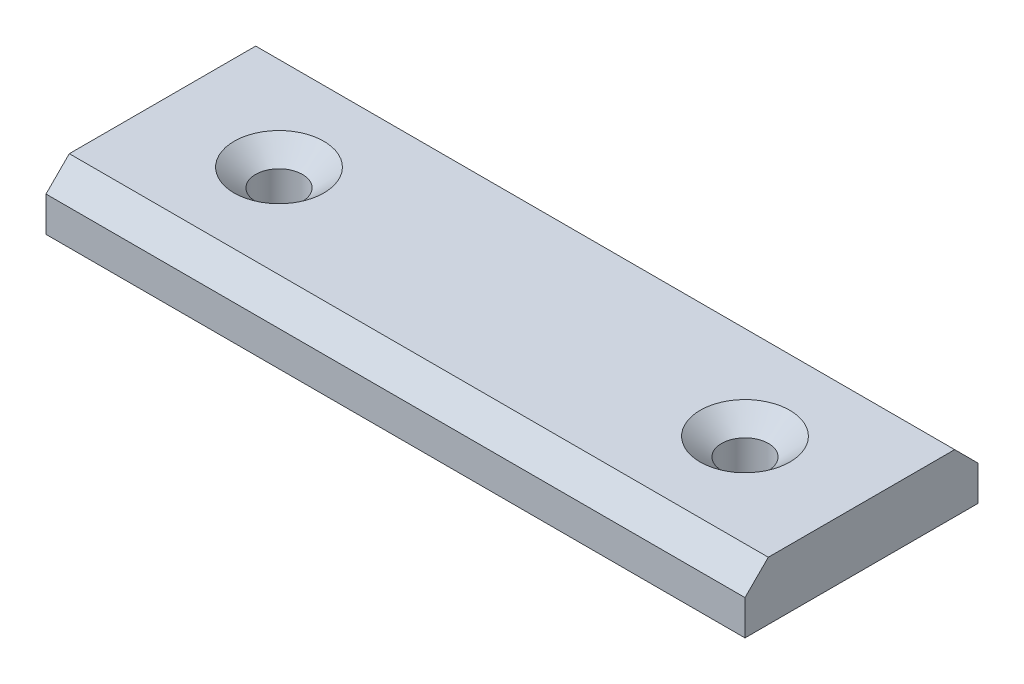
ISO-10303-21;
HEADER;
FILE_DESCRIPTION(('STEP AP214'),'2;1');
FILE_NAME('part.step','',(''),(''),'','','');
FILE_SCHEMA(('AUTOMOTIVE_DESIGN { 1 0 10303 214 1 1 1 1 }'));
ENDSEC;
DATA;
#1=APPLICATION_CONTEXT('core data for automotive mechanical design processes');
#2=APPLICATION_PROTOCOL_DEFINITION('international standard','automotive_design',2000,#1);
#3=PRODUCT_CONTEXT('',#1,'mechanical');
#4=PRODUCT('Part','Part','',(#3));
#5=PRODUCT_RELATED_PRODUCT_CATEGORY('part','',(#4));
#6=PRODUCT_DEFINITION_FORMATION('','',#4);
#7=PRODUCT_DEFINITION_CONTEXT('part definition',#1,'design');
#8=PRODUCT_DEFINITION('design','',#6,#7);
#9=PRODUCT_DEFINITION_SHAPE('','',#8);
#10=(LENGTH_UNIT() NAMED_UNIT(*) SI_UNIT(.MILLI.,.METRE.));
#11=(NAMED_UNIT(*) PLANE_ANGLE_UNIT() SI_UNIT($,.RADIAN.));
#12=(NAMED_UNIT(*) SI_UNIT($,.STERADIAN.) SOLID_ANGLE_UNIT());
#13=UNCERTAINTY_MEASURE_WITH_UNIT(LENGTH_MEASURE(1.E-05),#10,'distance_accuracy_value','');
#14=(GEOMETRIC_REPRESENTATION_CONTEXT(3) GLOBAL_UNCERTAINTY_ASSIGNED_CONTEXT((#13)) GLOBAL_UNIT_ASSIGNED_CONTEXT((#10,
#11,#12)) REPRESENTATION_CONTEXT('',''));
#15=CARTESIAN_POINT('',(0.,0.,0.));
#16=DIRECTION('',(0.,0.,1.));
#17=DIRECTION('',(1.,0.,0.));
#18=AXIS2_PLACEMENT_3D('',#15,#16,#17);
#19=CARTESIAN_POINT('',(-36.3341725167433,6.35,-42.4899862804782));
#20=DIRECTION('',(1.,0.,0.));
#21=DIRECTION('',(0.,0.,-1.));
#22=AXIS2_PLACEMENT_3D('',#19,#20,#21);
#23=PLANE('',#22);
#24=DIRECTION('',(0.,0.,1.));
#25=VECTOR('',#24,1.);
#26=CARTESIAN_POINT('',(-36.3341725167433,6.35,-42.4899862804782));
#27=LINE('',#26,#25);
#28=CARTESIAN_POINT('',(-36.3341725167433,6.35,-39.9499862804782));
#29=VERTEX_POINT('',#28);
#30=CARTESIAN_POINT('',(-36.3341725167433,6.35,-19.6299862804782));
#31=VERTEX_POINT('',#30);
#32=EDGE_CURVE('E121',#29,#31,#27,.T.);
#33=ORIENTED_EDGE('',*,*,#32,.F.);
#34=DIRECTION('',(0.,-0.707106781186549,-0.707106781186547));
#35=VECTOR('',#34,1.);
#36=CARTESIAN_POINT('',(-36.3341725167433,6.35,-39.9499862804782));
#37=LINE('',#36,#35);
#38=CARTESIAN_POINT('',(-36.3341725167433,3.81,-42.4899862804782));
#39=VERTEX_POINT('',#38);
#40=EDGE_CURVE('E138',#29,#39,#37,.T.);
#41=ORIENTED_EDGE('',*,*,#40,.T.);
#42=DIRECTION('',(0.,-1.,0.));
#43=VECTOR('',#42,1.);
#44=CARTESIAN_POINT('',(-36.3341725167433,6.35,-42.4899862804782));
#45=LINE('',#44,#43);
#46=CARTESIAN_POINT('',(-36.3341725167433,0.,-42.4899862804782));
#47=VERTEX_POINT('',#46);
#48=EDGE_CURVE('E109',#39,#47,#45,.T.);
#49=ORIENTED_EDGE('',*,*,#48,.T.);
#50=DIRECTION('',(0.,0.,1.));
#51=VECTOR('',#50,1.);
#52=CARTESIAN_POINT('',(-36.3341725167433,0.,-42.4899862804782));
#53=LINE('',#52,#51);
#54=CARTESIAN_POINT('',(-36.3341725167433,0.,-17.0899862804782));
#55=VERTEX_POINT('',#54);
#56=EDGE_CURVE('E104',#47,#55,#53,.T.);
#57=ORIENTED_EDGE('',*,*,#56,.T.);
#58=DIRECTION('',(0.,-1.,0.));
#59=VECTOR('',#58,1.);
#60=CARTESIAN_POINT('',(-36.3341725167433,6.35,-17.0899862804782));
#61=LINE('',#60,#59);
#62=CARTESIAN_POINT('',(-36.3341725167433,3.80999999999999,-17.0899862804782));
#63=VERTEX_POINT('',#62);
#64=EDGE_CURVE('E88',#63,#55,#61,.T.);
#65=ORIENTED_EDGE('',*,*,#64,.F.);
#66=DIRECTION('',(0.,0.707106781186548,-0.707106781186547));
#67=VECTOR('',#66,1.);
#68=CARTESIAN_POINT('',(-36.3341725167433,6.35,-19.6299862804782));
#69=LINE('',#68,#67);
#70=EDGE_CURVE('E136',#63,#31,#69,.T.);
#71=ORIENTED_EDGE('',*,*,#70,.T.);
#72=EDGE_LOOP('',(#33,#41,#49,#57,#65,#71));
#73=FACE_BOUND('',#72,.T.);
#74=ADVANCED_FACE('F36',(#73),#23,.F.);
#75=CARTESIAN_POINT('',(-36.3341725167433,6.35,-17.0899862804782));
#76=DIRECTION('',(0.,0.,-1.));
#77=DIRECTION('',(-1.,0.,0.));
#78=AXIS2_PLACEMENT_3D('',#75,#76,#77);
#79=PLANE('',#78);
#80=DIRECTION('',(0.,-1.,0.));
#81=VECTOR('',#80,1.);
#82=CARTESIAN_POINT('',(39.8658274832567,6.35,-17.0899862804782));
#83=LINE('',#82,#81);
#84=CARTESIAN_POINT('',(39.8658274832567,3.80999999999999,-17.0899862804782));
#85=VERTEX_POINT('',#84);
#86=CARTESIAN_POINT('',(39.8658274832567,0.,-17.0899862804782));
#87=VERTEX_POINT('',#86);
#88=EDGE_CURVE('E98',#85,#87,#83,.T.);
#89=ORIENTED_EDGE('',*,*,#88,.F.);
#90=DIRECTION('',(-1.,0.,0.));
#91=VECTOR('',#90,1.);
#92=CARTESIAN_POINT('',(-36.3341725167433,3.80999999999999,-17.0899862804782));
#93=LINE('',#92,#91);
#94=EDGE_CURVE('E11',#85,#63,#93,.T.);
#95=ORIENTED_EDGE('',*,*,#94,.T.);
#96=ORIENTED_EDGE('',*,*,#64,.T.);
#97=DIRECTION('',(1.,0.,0.));
#98=VECTOR('',#97,1.);
#99=CARTESIAN_POINT('',(-36.3341725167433,0.,-17.0899862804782));
#100=LINE('',#99,#98);
#101=EDGE_CURVE('E91',#55,#87,#100,.T.);
#102=ORIENTED_EDGE('',*,*,#101,.T.);
#103=EDGE_LOOP('',(#89,#95,#96,#102));
#104=FACE_BOUND('',#103,.T.);
#105=ADVANCED_FACE('F90',(#104),#79,.F.);
#106=CARTESIAN_POINT('',(39.8658274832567,6.35,-42.4899862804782));
#107=DIRECTION('',(-1.,0.,0.));
#108=DIRECTION('',(0.,0.,1.));
#109=AXIS2_PLACEMENT_3D('',#106,#107,#108);
#110=PLANE('',#109);
#111=DIRECTION('',(0.,-1.,0.));
#112=VECTOR('',#111,1.);
#113=CARTESIAN_POINT('',(39.8658274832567,6.35,-42.4899862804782));
#114=LINE('',#113,#112);
#115=CARTESIAN_POINT('',(39.8658274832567,3.81,-42.4899862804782));
#116=VERTEX_POINT('',#115);
#117=CARTESIAN_POINT('',(39.8658274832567,0.,-42.4899862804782));
#118=VERTEX_POINT('',#117);
#119=EDGE_CURVE('E128',#116,#118,#114,.T.);
#120=ORIENTED_EDGE('',*,*,#119,.F.);
#121=DIRECTION('',(0.,0.707106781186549,0.707106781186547));
#122=VECTOR('',#121,1.);
#123=CARTESIAN_POINT('',(39.8658274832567,6.35,-39.9499862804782));
#124=LINE('',#123,#122);
#125=CARTESIAN_POINT('',(39.8658274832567,6.35,-39.9499862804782));
#126=VERTEX_POINT('',#125);
#127=EDGE_CURVE('E43',#116,#126,#124,.T.);
#128=ORIENTED_EDGE('',*,*,#127,.T.);
#129=DIRECTION('',(0.,0.,-1.));
#130=VECTOR('',#129,1.);
#131=CARTESIAN_POINT('',(39.8658274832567,6.35,-42.4899862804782));
#132=LINE('',#131,#130);
#133=CARTESIAN_POINT('',(39.8658274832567,6.35,-19.6299862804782));
#134=VERTEX_POINT('',#133);
#135=EDGE_CURVE('E124',#134,#126,#132,.T.);
#136=ORIENTED_EDGE('',*,*,#135,.F.);
#137=DIRECTION('',(0.,-0.707106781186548,0.707106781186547));
#138=VECTOR('',#137,1.);
#139=CARTESIAN_POINT('',(39.8658274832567,6.35,-19.6299862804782));
#140=LINE('',#139,#138);
#141=EDGE_CURVE('E50',#134,#85,#140,.T.);
#142=ORIENTED_EDGE('',*,*,#141,.T.);
#143=ORIENTED_EDGE('',*,*,#88,.T.);
#144=DIRECTION('',(0.,0.,-1.));
#145=VECTOR('',#144,1.);
#146=CARTESIAN_POINT('',(39.8658274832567,0.,-42.4899862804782));
#147=LINE('',#146,#145);
#148=EDGE_CURVE('E106',#87,#118,#147,.T.);
#149=ORIENTED_EDGE('',*,*,#148,.T.);
#150=EDGE_LOOP('',(#120,#128,#136,#142,#143,#149));
#151=FACE_BOUND('',#150,.T.);
#152=ADVANCED_FACE('F142',(#151),#110,.F.);
#153=CARTESIAN_POINT('',(-36.3341725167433,6.35,-42.4899862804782));
#154=DIRECTION('',(0.,0.,1.));
#155=DIRECTION('',(1.,0.,0.));
#156=AXIS2_PLACEMENT_3D('',#153,#154,#155);
#157=PLANE('',#156);
#158=ORIENTED_EDGE('',*,*,#48,.F.);
#159=DIRECTION('',(1.,0.,0.));
#160=VECTOR('',#159,1.);
#161=CARTESIAN_POINT('',(39.8658274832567,3.81,-42.4899862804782));
#162=LINE('',#161,#160);
#163=EDGE_CURVE('E58',#39,#116,#162,.T.);
#164=ORIENTED_EDGE('',*,*,#163,.T.);
#165=ORIENTED_EDGE('',*,*,#119,.T.);
#166=DIRECTION('',(-1.,0.,0.));
#167=VECTOR('',#166,1.);
#168=CARTESIAN_POINT('',(-36.3341725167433,0.,-42.4899862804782));
#169=LINE('',#168,#167);
#170=EDGE_CURVE('E119',#118,#47,#169,.T.);
#171=ORIENTED_EDGE('',*,*,#170,.T.);
#172=EDGE_LOOP('',(#158,#164,#165,#171));
#173=FACE_BOUND('',#172,.T.);
#174=ADVANCED_FACE('F149',(#173),#157,.F.);
#175=CARTESIAN_POINT('',(-36.3341725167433,6.35,-42.4899862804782));
#176=DIRECTION('',(0.,1.,0.));
#177=DIRECTION('',(0.,0.,1.));
#178=AXIS2_PLACEMENT_3D('',#175,#176,#177);
#179=PLANE('',#178);
#180=CARTESIAN_POINT('',(-23.6341725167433,6.35,-29.7899862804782));
#181=DIRECTION('',(0.,1.,0.));
#182=DIRECTION('',(0.,0.,1.));
#183=AXIS2_PLACEMENT_3D('',#180,#181,#182);
#184=CIRCLE('',#183,4.8895);
#185=CARTESIAN_POINT('',(-23.6341725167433,6.35,-24.9004862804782));
#186=VERTEX_POINT('',#185);
#187=EDGE_CURVE('E199',#186,#186,#184,.T.);
#188=ORIENTED_EDGE('',*,*,#187,.F.);
#189=EDGE_LOOP('',(#188));
#190=FACE_BOUND('',#189,.T.);
#191=CARTESIAN_POINT('',(27.1658274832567,6.35,-29.7899862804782));
#192=DIRECTION('',(0.,1.,0.));
#193=DIRECTION('',(0.,0.,1.));
#194=AXIS2_PLACEMENT_3D('',#191,#192,#193);
#195=CIRCLE('',#194,4.8895);
#196=CARTESIAN_POINT('',(27.1658274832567,6.35,-24.9004862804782));
#197=VERTEX_POINT('',#196);
#198=EDGE_CURVE('E111',#197,#197,#195,.T.);
#199=ORIENTED_EDGE('',*,*,#198,.F.);
#200=EDGE_LOOP('',(#199));
#201=FACE_BOUND('',#200,.T.);
#202=ORIENTED_EDGE('',*,*,#135,.T.);
#203=DIRECTION('',(-1.,0.,0.));
#204=VECTOR('',#203,1.);
#205=CARTESIAN_POINT('',(-36.3341725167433,6.35,-39.9499862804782));
#206=LINE('',#205,#204);
#207=EDGE_CURVE('E133',#126,#29,#206,.T.);
#208=ORIENTED_EDGE('',*,*,#207,.T.);
#209=ORIENTED_EDGE('',*,*,#32,.T.);
#210=DIRECTION('',(1.,0.,0.));
#211=VECTOR('',#210,1.);
#212=CARTESIAN_POINT('',(39.8658274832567,6.35,-19.6299862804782));
#213=LINE('',#212,#211);
#214=EDGE_CURVE('E97',#31,#134,#213,.T.);
#215=ORIENTED_EDGE('',*,*,#214,.T.);
#216=EDGE_LOOP('',(#202,#208,#209,#215));
#217=FACE_BOUND('',#216,.T.);
#218=ADVANCED_FACE('F146',(#190,#201,#217),#179,.T.);
#219=CARTESIAN_POINT('',(-36.3341725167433,0.,-42.4899862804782));
#220=DIRECTION('',(0.,1.,0.));
#221=DIRECTION('',(0.,0.,1.));
#222=AXIS2_PLACEMENT_3D('',#219,#220,#221);
#223=PLANE('',#222);
#224=CARTESIAN_POINT('',(-23.6341725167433,0.,-29.7899862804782));
#225=DIRECTION('',(0.,1.,0.));
#226=DIRECTION('',(0.,0.,1.));
#227=AXIS2_PLACEMENT_3D('',#224,#225,#226);
#228=CIRCLE('',#227,2.55269999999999);
#229=CARTESIAN_POINT('',(-23.6341725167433,0.,-27.2372862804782));
#230=VERTEX_POINT('',#229);
#231=EDGE_CURVE('E195',#230,#230,#228,.T.);
#232=ORIENTED_EDGE('',*,*,#231,.T.);
#233=EDGE_LOOP('',(#232));
#234=FACE_BOUND('',#233,.T.);
#235=CARTESIAN_POINT('',(27.1658274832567,0.,-29.7899862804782));
#236=DIRECTION('',(0.,1.,0.));
#237=DIRECTION('',(0.,0.,1.));
#238=AXIS2_PLACEMENT_3D('',#235,#236,#237);
#239=CIRCLE('',#238,2.5527);
#240=CARTESIAN_POINT('',(27.1658274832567,0.,-27.2372862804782));
#241=VERTEX_POINT('',#240);
#242=EDGE_CURVE('E202',#241,#241,#239,.T.);
#243=ORIENTED_EDGE('',*,*,#242,.T.);
#244=EDGE_LOOP('',(#243));
#245=FACE_BOUND('',#244,.T.);
#246=ORIENTED_EDGE('',*,*,#56,.F.);
#247=ORIENTED_EDGE('',*,*,#170,.F.);
#248=ORIENTED_EDGE('',*,*,#148,.F.);
#249=ORIENTED_EDGE('',*,*,#101,.F.);
#250=EDGE_LOOP('',(#246,#247,#248,#249));
#251=FACE_BOUND('',#250,.T.);
#252=ADVANCED_FACE('F102',(#234,#245,#251),#223,.F.);
#253=CARTESIAN_POINT('',(27.1658274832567,6.35,-29.7899862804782));
#254=DIRECTION('',(0.,1.,0.));
#255=DIRECTION('',(0.,0.,1.));
#256=AXIS2_PLACEMENT_3D('',#253,#254,#255);
#257=CONICAL_SURFACE('',#256,4.8895,0.872664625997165);
#258=CARTESIAN_POINT('',(27.1658274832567,4.38919198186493,-29.7899862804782));
#259=DIRECTION('',(0.,1.,0.));
#260=DIRECTION('',(0.,0.,1.));
#261=AXIS2_PLACEMENT_3D('',#258,#259,#260);
#262=CIRCLE('',#261,2.5527);
#263=CARTESIAN_POINT('',(27.1658274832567,4.38919198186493,-27.2372862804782));
#264=VERTEX_POINT('',#263);
#265=EDGE_CURVE('E114',#264,#264,#262,.T.);
#266=ORIENTED_EDGE('',*,*,#265,.F.);
#267=EDGE_LOOP('',(#266));
#268=FACE_BOUND('',#267,.T.);
#269=ORIENTED_EDGE('',*,*,#198,.T.);
#270=EDGE_LOOP('',(#269));
#271=FACE_BOUND('',#270,.T.);
#272=ADVANCED_FACE('F175',(#268,#271),#257,.F.);
#273=CARTESIAN_POINT('',(27.1658274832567,6.35,-29.7899862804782));
#274=DIRECTION('',(0.,1.,0.));
#275=DIRECTION('',(0.,0.,1.));
#276=AXIS2_PLACEMENT_3D('',#273,#274,#275);
#277=CYLINDRICAL_SURFACE('',#276,2.5527);
#278=ORIENTED_EDGE('',*,*,#242,.F.);
#279=EDGE_LOOP('',(#278));
#280=FACE_BOUND('',#279,.T.);
#281=ORIENTED_EDGE('',*,*,#265,.T.);
#282=EDGE_LOOP('',(#281));
#283=FACE_BOUND('',#282,.T.);
#284=ADVANCED_FACE('F179',(#280,#283),#277,.F.);
#285=CARTESIAN_POINT('',(-23.6341725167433,6.35,-29.7899862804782));
#286=DIRECTION('',(0.,1.,0.));
#287=DIRECTION('',(0.,0.,1.));
#288=AXIS2_PLACEMENT_3D('',#285,#286,#287);
#289=CONICAL_SURFACE('',#288,4.8895,0.872664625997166);
#290=CARTESIAN_POINT('',(-23.6341725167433,4.38919198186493,-29.7899862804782));
#291=DIRECTION('',(0.,1.,0.));
#292=DIRECTION('',(0.,0.,1.));
#293=AXIS2_PLACEMENT_3D('',#290,#291,#292);
#294=CIRCLE('',#293,2.5527);
#295=CARTESIAN_POINT('',(-23.6341725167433,4.38919198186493,-27.2372862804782));
#296=VERTEX_POINT('',#295);
#297=EDGE_CURVE('E198',#296,#296,#294,.T.);
#298=ORIENTED_EDGE('',*,*,#297,.F.);
#299=EDGE_LOOP('',(#298));
#300=FACE_BOUND('',#299,.T.);
#301=ORIENTED_EDGE('',*,*,#187,.T.);
#302=EDGE_LOOP('',(#301));
#303=FACE_BOUND('',#302,.T.);
#304=ADVANCED_FACE('F183',(#300,#303),#289,.F.);
#305=CARTESIAN_POINT('',(-23.6341725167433,6.35,-29.7899862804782));
#306=DIRECTION('',(0.,1.,0.));
#307=DIRECTION('',(0.,0.,1.));
#308=AXIS2_PLACEMENT_3D('',#305,#306,#307);
#309=CYLINDRICAL_SURFACE('',#308,2.5527);
#310=ORIENTED_EDGE('',*,*,#231,.F.);
#311=EDGE_LOOP('',(#310));
#312=FACE_BOUND('',#311,.T.);
#313=ORIENTED_EDGE('',*,*,#297,.T.);
#314=EDGE_LOOP('',(#313));
#315=FACE_BOUND('',#314,.T.);
#316=ADVANCED_FACE('F157',(#312,#315),#309,.F.);
#317=CARTESIAN_POINT('',(-36.3341725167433,6.35,-39.9499862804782));
#318=DIRECTION('',(0.,0.707106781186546,-0.707106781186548));
#319=DIRECTION('',(0.,0.707106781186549,0.707106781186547));
#320=AXIS2_PLACEMENT_3D('',#317,#318,#319);
#321=PLANE('',#320);
#322=ORIENTED_EDGE('',*,*,#127,.F.);
#323=ORIENTED_EDGE('',*,*,#163,.F.);
#324=ORIENTED_EDGE('',*,*,#40,.F.);
#325=ORIENTED_EDGE('',*,*,#207,.F.);
#326=EDGE_LOOP('',(#322,#323,#324,#325));
#327=FACE_BOUND('',#326,.T.);
#328=ADVANCED_FACE('F148',(#327),#321,.T.);
#329=CARTESIAN_POINT('',(-36.3341725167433,6.35,-19.6299862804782));
#330=DIRECTION('',(0.,0.707106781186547,0.707106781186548));
#331=DIRECTION('',(0.,-0.707106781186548,0.707106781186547));
#332=AXIS2_PLACEMENT_3D('',#329,#330,#331);
#333=PLANE('',#332);
#334=ORIENTED_EDGE('',*,*,#70,.F.);
#335=ORIENTED_EDGE('',*,*,#94,.F.);
#336=ORIENTED_EDGE('',*,*,#141,.F.);
#337=ORIENTED_EDGE('',*,*,#214,.F.);
#338=EDGE_LOOP('',(#334,#335,#336,#337));
#339=FACE_BOUND('',#338,.T.);
#340=ADVANCED_FACE('F151',(#339),#333,.T.);
#341=CLOSED_SHELL('',(#74,#105,#152,#174,#218,#252,#272,#284,#304,#316,#328,#340));
#342=MANIFOLD_SOLID_BREP('B2',#341);
#343=ADVANCED_BREP_SHAPE_REPRESENTATION('',(#18,#342),#14);
#344=SHAPE_DEFINITION_REPRESENTATION(#9,#343);
ENDSEC;
END-ISO-10303-21;
